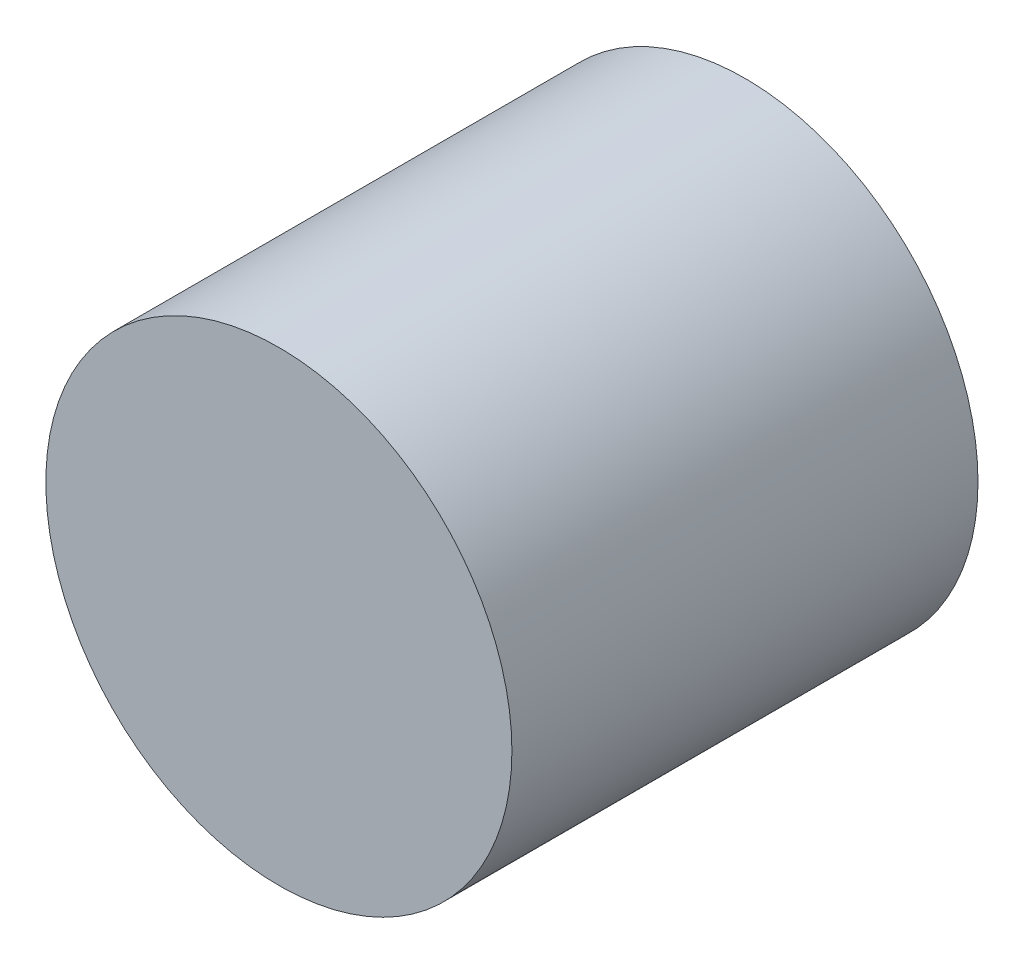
from build123d import *

# Parameters (mm, degrees)
SKETCH3_R           = 7.5
BOSS_EXTRUDE1_DEPTH = 7.5


with BuildPart() as part:
    # Sketch3 → Boss-Extrude1 (new, symmetric)
    with BuildSketch(Plane.XY):
        Circle(SKETCH3_R)
    extrude(amount=BOSS_EXTRUDE1_DEPTH, both=True)


solid = part.part
